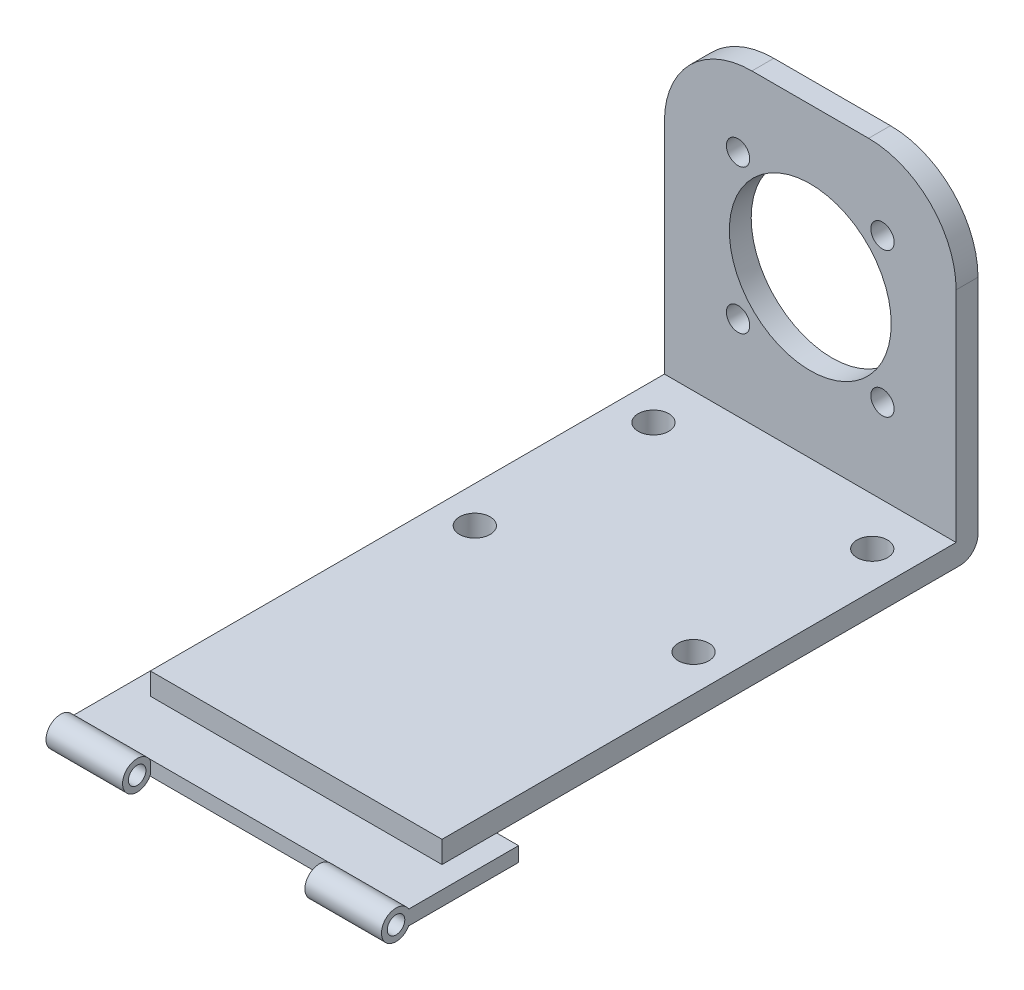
from build123d import *

# Parameters (mm, degrees)
BOSS_EXTRUDE1_DEPTH      = 40
SKETCH2_R                = 11.1
SKETCH2_R_2              = 1.6
CUT_EXTRUDE1_DEPTH       = 40
CUT_EXTRUDE2_DEPTH       = 40
SKETCH4_R                = 2.1
CUT_EXTRUDE3_DEPTH       = 40
SKETCH5_W                = 32
SKETCH5_H                = 3
BOSS_EXTRUDE2_DEPTH      = 40
SKETCH6_W                = 50
SKETCH6_H                = 15
BOSS_EXTRUDE3_DEPTH      = 2
BOSS_EXTRUDE4_DEPTH      = 12.5
BOSS_EXTRUDE4_DEPTH_BACK = 12.5
SKETCH8_R                = 2
SKETCH8_R_2              = 1.2
BOSS_EXTRUDE5_DEPTH      = 12.5
BOSS_EXTRUDE5_DEPTH_BACK = 12.5
SKETCH9_R                = 2
SKETCH9_R_2              = 1.2
CUT_EXTRUDE4_DEPTH       = 10
CUT_EXTRUDE4_DEPTH_BACK  = 10
SKETCH10_W               = 15.723105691
SKETCH10_H               = 30.005766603


with BuildPart() as part:
    # Sketch1 → Boss-Extrude1 (new body)
    with BuildSketch(Plane(origin=(0, 0, 0), x_dir=(0, 0, -1), z_dir=(1, 0, 0))):
        with BuildLine():
            Line((23.14644626, 33.419460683), (23.14644626, -8.580539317))
            Line((23.14644626, -8.580539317), (-15.35355374, -8.580539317))
            Line((-15.35355374, -8.580539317), (-15.35355374, -11.580539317))
            Line((-15.35355374, -11.580539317), (23.64644626, -11.580539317))
            ThreePointArc((23.64644626, -11.580539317), (25.414213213, -10.84830627), (26.14644626, -9.080539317))
            Line((26.14644626, -9.080539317), (26.14644626, 33.419460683))
            Line((26.14644626, 33.419460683), (23.14644626, 33.419460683))
        make_face()
    extrude(amount=-BOSS_EXTRUDE1_DEPTH)

    # Sketch2 → Cut-Extrude1 (cut)
    with BuildSketch(Plane.XY.offset(-23.14644626)):
        with Locations((-20, 12.919460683)):
            Circle(SKETCH2_R)
        with Locations((-10.100505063, 22.818955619)):
            Circle(SKETCH2_R_2)
        with Locations((-29.899494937, 3.019965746)):
            Circle(SKETCH2_R_2)
        with Locations((-29.899494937, 22.818955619)):
            Circle(SKETCH2_R_2)
        with Locations((-10.100505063, 3.019965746)):
            Circle(SKETCH2_R_2)
    extrude(amount=-CUT_EXTRUDE1_DEPTH, mode=Mode.SUBTRACT)

    # Sketch3 → Cut-Extrude2 (cut)
    with BuildSketch(Plane.XY.offset(-23.14644626)):
        with BuildLine():
            Line((0, 21.419460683), (0, 33.419460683))
            Line((0, 33.419460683), (-12, 33.419460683))
            ThreePointArc((-12, 33.419460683), (-3.514718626, 29.904742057), (0, 21.419460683))
        make_face()
        with BuildLine():
            Line((-28, 33.419460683), (-40, 33.419460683))
            Line((-40, 33.419460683), (-40, 21.419460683))
            ThreePointArc((-40, 21.419460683), (-36.485281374, 29.904742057), (-28, 33.419460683))
        make_face()
    extrude(amount=-CUT_EXTRUDE2_DEPTH, mode=Mode.SUBTRACT)

    # Sketch4 → Cut-Extrude3 (cut)
    with BuildSketch(Plane(origin=(0, -8.580539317, 0), x_dir=(1, 0, 0), z_dir=(0, 1, 0))):
        with Locations(Location((-5, -7.85355374, 0), (0, 0, 270))):
            Circle(SKETCH4_R)
        with Locations(Location((-35, -7.85355374, 0), (0, 0, 270))):
            Circle(SKETCH4_R)
        with Locations(Location((-35, 16.64644626, 0), (0, 0, 270))):
            Circle(SKETCH4_R)
        with Locations(Location((-5, 16.64644626, 0), (0, 0, 270))):
            Circle(SKETCH4_R)
    extrude(amount=-CUT_EXTRUDE3_DEPTH, mode=Mode.SUBTRACT)

    # Sketch5 → Boss-Extrude2 (add)
    with BuildSketch(Plane.ZY.offset(40)):
        with Locations((31.35355374, -10.080539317)):
            Rectangle(SKETCH5_W, SKETCH5_H)
    extrude(amount=-BOSS_EXTRUDE2_DEPTH)

    # Sketch6 → Boss-Extrude3 (add)
    with BuildSketch(Plane.XZ.offset(11.580539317)):
        with Locations((-20, 47.35355374)):
            Rectangle(SKETCH6_W, SKETCH6_H)
    extrude(amount=BOSS_EXTRUDE3_DEPTH)

    # Sketch8 → Boss-Extrude4 (add, two sides: drawn at the far end of the back side and taken through both)
    with BuildSketch(Plane.ZY.offset(45).offset(-BOSS_EXTRUDE4_DEPTH_BACK)):
        with Locations((56.65355374, -12.580539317)):
            Circle(SKETCH8_R)
        with Locations((56.65355374, -12.580539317)):
            Circle(SKETCH8_R_2, mode=Mode.SUBTRACT)
    extrude(amount=BOSS_EXTRUDE4_DEPTH + BOSS_EXTRUDE4_DEPTH_BACK)

    # Sketch9 → Boss-Extrude5 (add, two sides: drawn at the far end of the back side and taken through both)
    with BuildSketch(Plane(origin=(5, 0, 0), x_dir=(0, 0, -1), z_dir=(1, 0, 0)).offset(-BOSS_EXTRUDE5_DEPTH_BACK)):
        with Locations(Location((-56.65355374, -12.580539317, 0), (0, 0, 180))):
            Circle(SKETCH9_R)
        with Locations(Location((-56.65355374, -12.580539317, 0), (0, 0, 180))):
            Circle(SKETCH9_R_2, mode=Mode.SUBTRACT)
    extrude(amount=BOSS_EXTRUDE5_DEPTH + BOSS_EXTRUDE5_DEPTH_BACK)

    # Sketch10 → Cut-Extrude4 (cut, two sides: drawn at the far end of the back side and taken through both)
    with BuildSketch(Plane(origin=(0, -11.580539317, 0), x_dir=(1, 0, 0), z_dir=(0, 1, 0)).offset(-CUT_EXTRUDE4_DEPTH_BACK)):
        Polygon((7.094558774, -36.297911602), (3, -36.297911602), (3, -66.303678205), (7.094558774, -66.303678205), (21.060153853, -66.303678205), (21.060153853, -36.297911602), align=None)
        with Locations((-50.861552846, -51.300794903)):
            Rectangle(SKETCH10_W, SKETCH10_H)
    extrude(amount=CUT_EXTRUDE4_DEPTH + CUT_EXTRUDE4_DEPTH_BACK, mode=Mode.SUBTRACT)


solid = part.part
